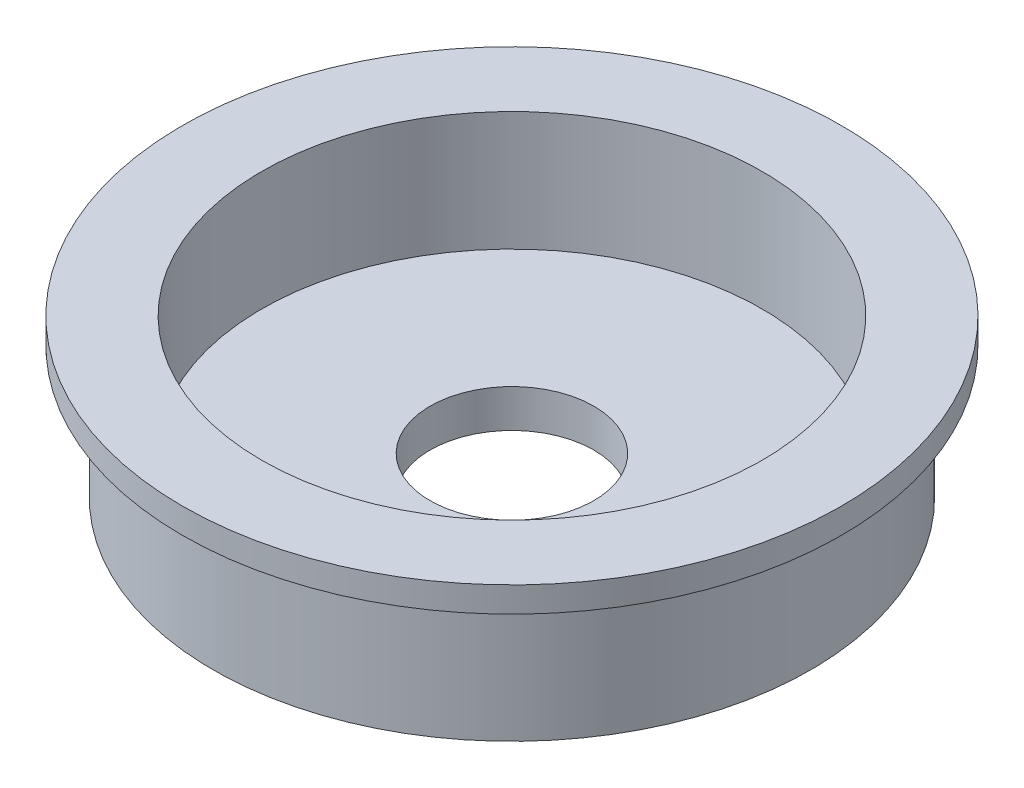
from build123d import *

# Parameters (mm, degrees)
SKETCH1_R           = 14.9733
SKETCH1_R_2         = 4.1021
BOSS_EXTRUDE1_DEPTH = 6.604
SKETCH2_R           = 16.51
SKETCH2_R_2         = 4.1021
BOSS_EXTRUDE2_DEPTH = 1.27
SKETCH3_R           = 12.5349
CUT_EXTRUDE1_DEPTH  = 5.969


with BuildPart() as part:
    # Sketch1 → Boss-Extrude1 (new body)
    with BuildSketch(Plane(origin=(0, 0, 0), x_dir=(1, 0, 0), z_dir=(0, 1, 0))):
        with Locations(Location((0, 0, 0), (0, 0, 90))):
            Circle(SKETCH1_R)
        with Locations(Location((0, 0, 0), (0, 0, 90))):
            Circle(SKETCH1_R_2, mode=Mode.SUBTRACT)
    extrude(amount=BOSS_EXTRUDE1_DEPTH)

    # Sketch2 → Boss-Extrude2 (add)
    with BuildSketch(Plane(origin=(0, 6.604, 0), x_dir=(1, 0, 0), z_dir=(0, 1, 0))):
        with Locations(Location((0, 0, 0), (0, 0, 270))):
            Circle(SKETCH2_R)
        with Locations(Location((0, 0, 0), (0, 0, 90))):
            Circle(SKETCH2_R_2, mode=Mode.SUBTRACT)
    extrude(amount=BOSS_EXTRUDE2_DEPTH)

    # Sketch3 → Cut-Extrude1 (cut)
    with BuildSketch(Plane(origin=(0, 7.874, 0), x_dir=(1, 0, 0), z_dir=(0, 1, 0))):
        with Locations(Location((0, 0, 0), (0, 0, 270))):
            Circle(SKETCH3_R)
    extrude(amount=-CUT_EXTRUDE1_DEPTH, mode=Mode.SUBTRACT)


solid = part.part
